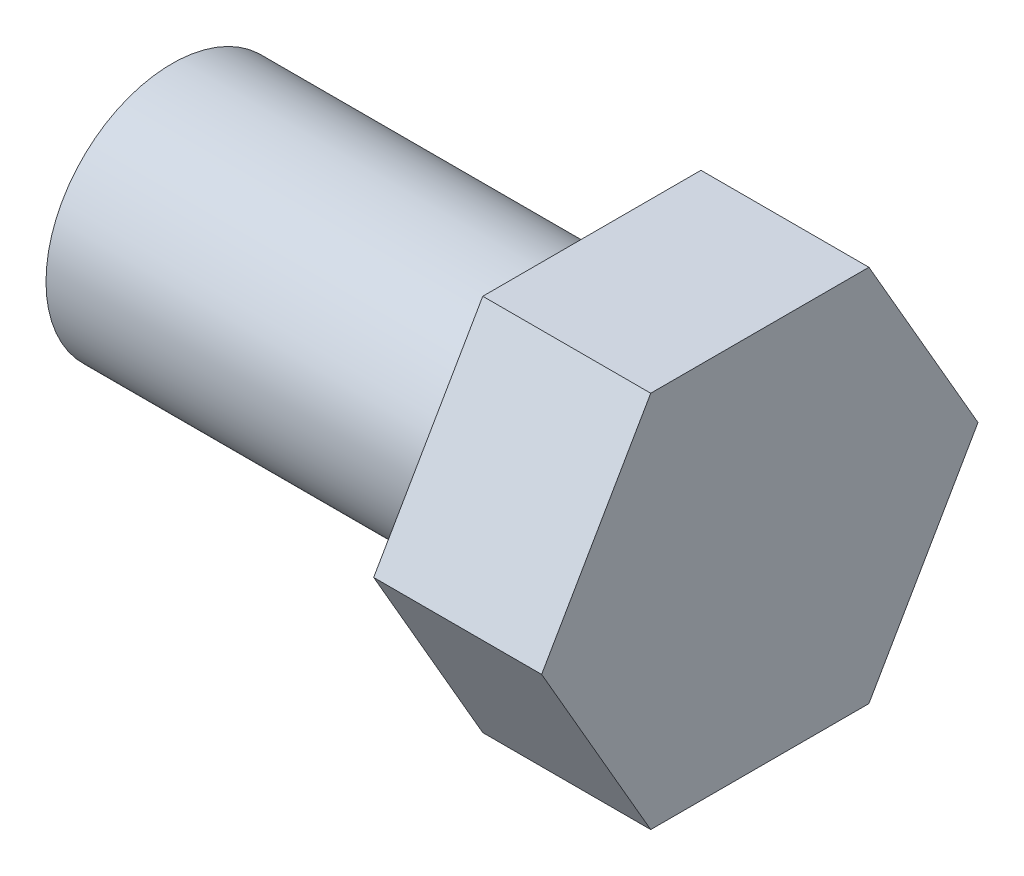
from build123d import *

# Parameters (mm, degrees)
BOSS_EXTRUDE1_DEPTH = 6.35
SKETCH2_R           = 4.7625
BOSS_EXTRUDE2_DEPTH = 15.875


with BuildPart() as part:
    # Sketch1 → Boss-Extrude1 (new body)
    with BuildSketch(Plane(origin=(0, 0, 0), x_dir=(0, 0, -1), z_dir=(1, 0, 0))):
        Polygon((4.124445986, 7.14375), (-4.124445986, 7.14375), (-8.248891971, 0), (-4.124445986, -7.14375), (4.124445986, -7.14375), (8.248891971, 0), align=None)
    extrude(amount=BOSS_EXTRUDE1_DEPTH)

    # Sketch2 → Boss-Extrude2 (add)
    with BuildSketch(Plane.ZY):
        with Locations(Location((0, 0, 0), (0, 0, 180))):
            Circle(SKETCH2_R)
    extrude(amount=BOSS_EXTRUDE2_DEPTH)


solid = part.part
